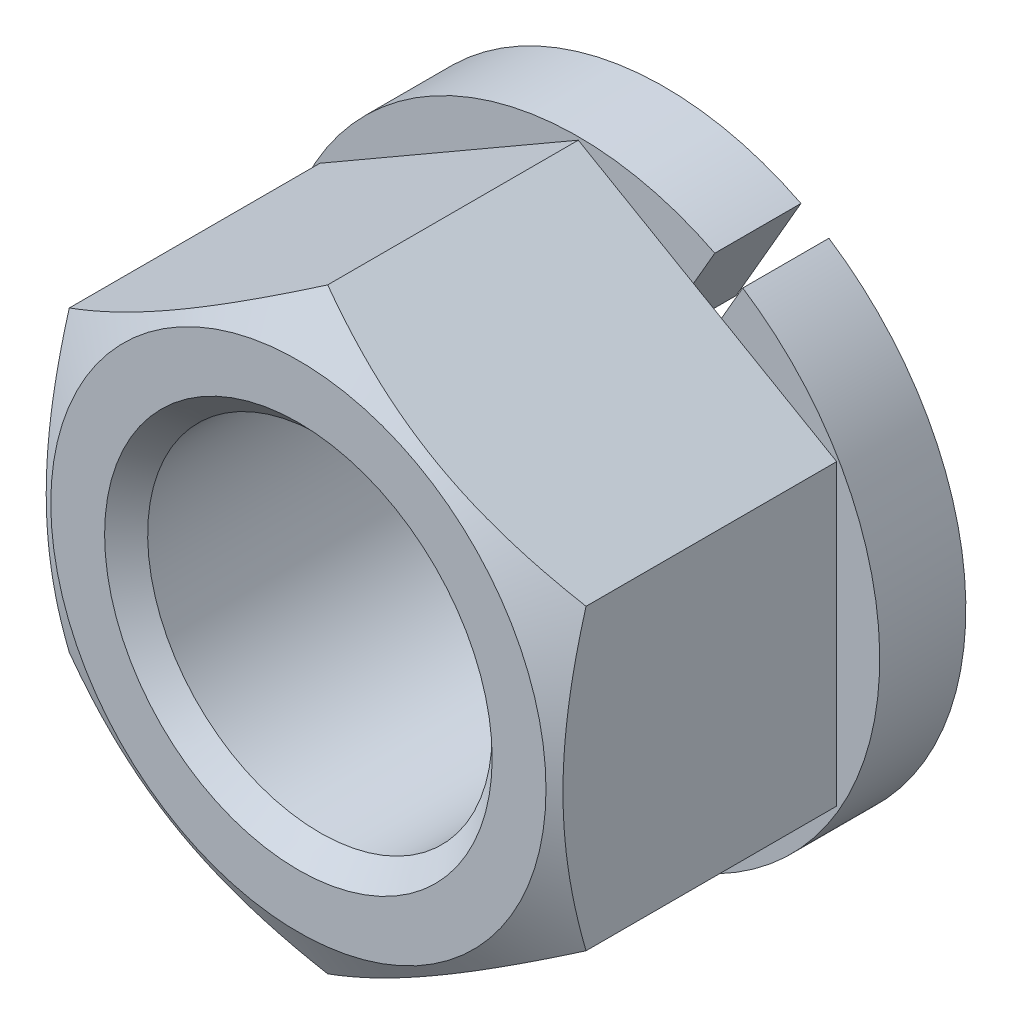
ISO-10303-21;
HEADER;
FILE_DESCRIPTION(('STEP AP214'),'2;1');
FILE_NAME('part.step','',(''),(''),'','','');
FILE_SCHEMA(('AUTOMOTIVE_DESIGN { 1 0 10303 214 1 1 1 1 }'));
ENDSEC;
DATA;
#1=APPLICATION_CONTEXT('core data for automotive mechanical design processes');
#2=APPLICATION_PROTOCOL_DEFINITION('international standard','automotive_design',2000,#1);
#3=PRODUCT_CONTEXT('',#1,'mechanical');
#4=PRODUCT('Part','Part','',(#3));
#5=PRODUCT_RELATED_PRODUCT_CATEGORY('part','',(#4));
#6=PRODUCT_DEFINITION_FORMATION('','',#4);
#7=PRODUCT_DEFINITION_CONTEXT('part definition',#1,'design');
#8=PRODUCT_DEFINITION('design','',#6,#7);
#9=PRODUCT_DEFINITION_SHAPE('','',#8);
#10=(LENGTH_UNIT() NAMED_UNIT(*) SI_UNIT(.MILLI.,.METRE.));
#11=(NAMED_UNIT(*) PLANE_ANGLE_UNIT() SI_UNIT($,.RADIAN.));
#12=(NAMED_UNIT(*) SI_UNIT($,.STERADIAN.) SOLID_ANGLE_UNIT());
#13=UNCERTAINTY_MEASURE_WITH_UNIT(LENGTH_MEASURE(1.E-05),#10,'distance_accuracy_value','');
#14=(GEOMETRIC_REPRESENTATION_CONTEXT(3) GLOBAL_UNCERTAINTY_ASSIGNED_CONTEXT((#13)) GLOBAL_UNIT_ASSIGNED_CONTEXT((#10,
#11,#12)) REPRESENTATION_CONTEXT('',''));
#15=CARTESIAN_POINT('',(0.,0.,0.));
#16=DIRECTION('',(0.,0.,1.));
#17=DIRECTION('',(1.,0.,0.));
#18=AXIS2_PLACEMENT_3D('',#15,#16,#17);
#19=CARTESIAN_POINT('',(-12.,20.7846096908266,17.));
#20=DIRECTION('',(0.,0.,1.));
#21=DIRECTION('',(1.,0.,0.));
#22=AXIS2_PLACEMENT_3D('',#19,#20,#21);
#23=PLANE('',#22);
#24=CARTESIAN_POINT('',(0.,0.,17.));
#25=DIRECTION('',(0.,0.,1.));
#26=DIRECTION('',(1.,0.,0.));
#27=AXIS2_PLACEMENT_3D('',#24,#25,#26);
#28=CIRCLE('',#27,9.);
#29=CARTESIAN_POINT('',(9.,0.,17.));
#30=VERTEX_POINT('',#29);
#31=EDGE_CURVE('E9',#30,#30,#28,.F.);
#32=ORIENTED_EDGE('',*,*,#31,.T.);
#33=EDGE_LOOP('',(#32));
#34=FACE_BOUND('',#33,.T.);
#35=CARTESIAN_POINT('',(0.,0.,17.));
#36=DIRECTION('',(0.,0.,-1.));
#37=DIRECTION('',(-1.,0.,0.));
#38=AXIS2_PLACEMENT_3D('',#35,#36,#37);
#39=CIRCLE('',#38,11.5);
#40=CARTESIAN_POINT('',(-11.5,0.,17.));
#41=VERTEX_POINT('',#40);
#42=EDGE_CURVE('E137',#41,#41,#39,.T.);
#43=ORIENTED_EDGE('',*,*,#42,.F.);
#44=EDGE_LOOP('',(#43));
#45=FACE_BOUND('',#44,.T.);
#46=ADVANCED_FACE('F14',(#34,#45),#23,.T.);
#47=CARTESIAN_POINT('',(12.,6.92820323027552,17.));
#48=DIRECTION('',(-0.5,-0.866025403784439,0.));
#49=DIRECTION('',(0.866025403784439,-0.5,0.));
#50=AXIS2_PLACEMENT_3D('',#47,#48,#49);
#51=PLANE('',#50);
#52=DIRECTION('',(0.,0.,-1.));
#53=VECTOR('',#52,1.);
#54=CARTESIAN_POINT('',(0.,13.856406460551,17.));
#55=LINE('',#54,#53);
#56=CARTESIAN_POINT('',(0.,13.856406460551,15.6395280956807));
#57=VERTEX_POINT('',#56);
#58=CARTESIAN_POINT('',(0.,13.856406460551,4.));
#59=VERTEX_POINT('',#58);
#60=EDGE_CURVE('E221',#57,#59,#55,.T.);
#61=ORIENTED_EDGE('',*,*,#60,.F.);
#62=CARTESIAN_POINT('',(-0.0002,13.8565219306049,15.6394614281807));
#63=CARTESIAN_POINT('',(0.263585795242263,13.7042251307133,15.7273752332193));
#64=CARTESIAN_POINT('',(0.528355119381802,13.5513604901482,15.8112988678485));
#65=CARTESIAN_POINT('',(1.06001701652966,13.244405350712,15.9700586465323));
#66=CARTESIAN_POINT('',(1.32691025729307,13.0903144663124,16.0448918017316));
#67=CARTESIAN_POINT('',(2.13189040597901,12.6255589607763,16.254307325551));
#68=CARTESIAN_POINT('',(2.67315507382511,12.3130596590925,16.3734216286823));
#69=CARTESIAN_POINT('',(3.48313282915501,11.8454187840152,16.513093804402));
#70=CARTESIAN_POINT('',(3.74942610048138,11.6916742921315,16.5528810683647));
#71=CARTESIAN_POINT('',(4.28324559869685,11.3834734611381,16.6196014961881));
#72=CARTESIAN_POINT('',(4.55077184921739,11.2290171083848,16.6465344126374));
#73=CARTESIAN_POINT('',(5.08627036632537,10.9198468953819,16.6868562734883));
#74=CARTESIAN_POINT('',(5.35424172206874,10.7651335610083,16.7002613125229));
#75=CARTESIAN_POINT('',(5.89043273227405,10.4555635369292,16.713241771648));
#76=CARTESIAN_POINT('',(6.15865237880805,10.3007068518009,16.7128176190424));
#77=CARTESIAN_POINT('',(6.66008937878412,10.011202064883,16.6991048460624));
#78=CARTESIAN_POINT('',(6.89334249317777,9.87653331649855,16.6874888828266));
#79=CARTESIAN_POINT('',(7.35931224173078,9.60750555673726,16.6540168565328));
#80=CARTESIAN_POINT('',(7.59202883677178,9.47314656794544,16.632160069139));
#81=CARTESIAN_POINT('',(8.05679907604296,9.2048113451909,16.5785874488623));
#82=CARTESIAN_POINT('',(8.28885201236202,9.07083551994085,16.5468634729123));
#83=CARTESIAN_POINT('',(8.75186996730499,8.80351197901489,16.4741130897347));
#84=CARTESIAN_POINT('',(8.98283491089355,8.67016430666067,16.433086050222));
#85=CARTESIAN_POINT('',(9.68394195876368,8.26537996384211,16.2950132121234));
#86=CARTESIAN_POINT('',(10.1520537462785,7.99511549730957,16.1841999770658));
#87=CARTESIAN_POINT('',(11.0812971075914,7.4586165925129,15.9326990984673));
#88=CARTESIAN_POINT('',(11.5424405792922,7.19237528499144,15.7920705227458));
#89=CARTESIAN_POINT('',(12.0002,6.92808776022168,15.6394614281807));
#90=B_SPLINE_CURVE_WITH_KNOTS('',3,(#62,#63,#64,#65,#66,#67,#68,#69,#70,#71,#72,#73,#74,#75,#76,
#77,#78,#79,#80,#81,#82,#83,#84,#85,#86,#87,#88,#89),.UNSPECIFIED.,.F.,.F.,(4,2,2,2,2,2,2,2,2,2,
2,2,2,4),(0.,0.951004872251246,1.90232158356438,3.80900466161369,4.73894551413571,
5.66890426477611,6.59775529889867,7.52657763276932,8.3351464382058,9.1437724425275,
9.95306755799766,10.7624176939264,12.4167102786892,14.0677556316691),.UNSPECIFIED.);
#91=CARTESIAN_POINT('',(12.,6.92820323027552,15.6395280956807));
#92=VERTEX_POINT('',#91);
#93=EDGE_CURVE('E196',#57,#92,#90,.T.);
#94=ORIENTED_EDGE('',*,*,#93,.T.);
#95=DIRECTION('',(0.,0.,-1.));
#96=VECTOR('',#95,1.);
#97=CARTESIAN_POINT('',(12.,6.92820323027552,17.));
#98=LINE('',#97,#96);
#99=CARTESIAN_POINT('',(12.,6.92820323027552,4.));
#100=VERTEX_POINT('',#99);
#101=EDGE_CURVE('E241',#92,#100,#98,.T.);
#102=ORIENTED_EDGE('',*,*,#101,.T.);
#103=DIRECTION('',(-0.866025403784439,0.5,0.));
#104=VECTOR('',#103,1.);
#105=CARTESIAN_POINT('',(12.,6.92820323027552,4.));
#106=LINE('',#105,#104);
#107=CARTESIAN_POINT('',(6.64951905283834,10.0173048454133,4.));
#108=VERTEX_POINT('',#107);
#109=EDGE_CURVE('E256',#100,#108,#106,.T.);
#110=ORIENTED_EDGE('',*,*,#109,.T.);
#111=DIRECTION('',(0.866025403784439,-0.5,0.));
#112=VECTOR('',#111,1.);
#113=CARTESIAN_POINT('',(12.,6.92820323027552,4.));
#114=LINE('',#113,#112);
#115=CARTESIAN_POINT('',(5.35048094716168,10.7673048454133,4.));
#116=VERTEX_POINT('',#115);
#117=EDGE_CURVE('E129',#116,#108,#114,.T.);
#118=ORIENTED_EDGE('',*,*,#117,.F.);
#119=EDGE_CURVE('E225',#116,#59,#106,.T.);
#120=ORIENTED_EDGE('',*,*,#119,.T.);
#121=EDGE_LOOP('',(#61,#94,#102,#110,#118,#120));
#122=FACE_BOUND('',#121,.T.);
#123=ADVANCED_FACE('F206',(#122),#51,.F.);
#124=CARTESIAN_POINT('',(0.,13.856406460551,17.));
#125=DIRECTION('',(0.5,-0.866025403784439,0.));
#126=DIRECTION('',(0.866025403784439,0.5,0.));
#127=AXIS2_PLACEMENT_3D('',#124,#125,#126);
#128=PLANE('',#127);
#129=DIRECTION('',(0.,0.,-1.));
#130=VECTOR('',#129,1.);
#131=CARTESIAN_POINT('',(-12.,6.92820323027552,17.));
#132=LINE('',#131,#130);
#133=CARTESIAN_POINT('',(-12.,6.92820323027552,15.6395280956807));
#134=VERTEX_POINT('',#133);
#135=CARTESIAN_POINT('',(-12.,6.92820323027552,4.));
#136=VERTEX_POINT('',#135);
#137=EDGE_CURVE('E228',#134,#136,#132,.T.);
#138=ORIENTED_EDGE('',*,*,#137,.F.);
#139=CARTESIAN_POINT('',(-12.0002,6.92808776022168,15.6394614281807));
#140=CARTESIAN_POINT('',(-11.7364142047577,7.0803845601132,15.7273752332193));
#141=CARTESIAN_POINT('',(-11.4716448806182,7.23324920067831,15.8112988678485));
#142=CARTESIAN_POINT('',(-10.9399829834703,7.5402043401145,15.9700586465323));
#143=CARTESIAN_POINT('',(-10.6730897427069,7.69429522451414,16.0448918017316));
#144=CARTESIAN_POINT('',(-9.86810959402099,8.15905073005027,16.254307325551));
#145=CARTESIAN_POINT('',(-9.3268449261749,8.47155003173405,16.3734216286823));
#146=CARTESIAN_POINT('',(-8.516867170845,8.93919090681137,16.513093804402));
#147=CARTESIAN_POINT('',(-8.25057389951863,9.09293539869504,16.5528810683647));
#148=CARTESIAN_POINT('',(-7.71675440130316,9.40113622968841,16.6196014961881));
#149=CARTESIAN_POINT('',(-7.44922815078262,9.55559258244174,16.6465344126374));
#150=CARTESIAN_POINT('',(-6.91372963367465,9.86476279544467,16.6868562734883));
#151=CARTESIAN_POINT('',(-6.64575827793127,10.0194761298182,16.7002613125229));
#152=CARTESIAN_POINT('',(-6.10956726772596,10.3290461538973,16.713241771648));
#153=CARTESIAN_POINT('',(-5.84134762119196,10.4839028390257,16.7128176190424));
#154=CARTESIAN_POINT('',(-5.33991062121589,10.7734076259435,16.6991048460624));
#155=CARTESIAN_POINT('',(-5.10665750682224,10.908076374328,16.6874888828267));
#156=CARTESIAN_POINT('',(-4.64068775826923,11.1771041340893,16.6540168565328));
#157=CARTESIAN_POINT('',(-4.40797116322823,11.3114631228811,16.632160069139));
#158=CARTESIAN_POINT('',(-3.94320092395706,11.5797983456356,16.5785874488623));
#159=CARTESIAN_POINT('',(-3.711147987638,11.7137741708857,16.5468634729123));
#160=CARTESIAN_POINT('',(-3.24813003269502,11.9810977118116,16.4741130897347));
#161=CARTESIAN_POINT('',(-3.01716508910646,12.1144453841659,16.433086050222));
#162=CARTESIAN_POINT('',(-2.31605804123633,12.5192297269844,16.2950132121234));
#163=CARTESIAN_POINT('',(-1.84794625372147,12.789494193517,16.1841999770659));
#164=CARTESIAN_POINT('',(-0.918702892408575,13.3259930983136,15.9326990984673));
#165=CARTESIAN_POINT('',(-0.457559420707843,13.5922344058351,15.7920705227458));
#166=CARTESIAN_POINT('',(0.000200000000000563,13.8565219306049,15.6394614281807));
#167=B_SPLINE_CURVE_WITH_KNOTS('',3,(#139,#140,#141,#142,#143,#144,#145,#146,#147,#148,#149,
#150,#151,#152,#153,#154,#155,#156,#157,#158,#159,#160,#161,#162,#163,#164,#165,#166),
.UNSPECIFIED.,.F.,.F.,(4,2,2,2,2,2,2,2,2,2,2,2,2,4),(0.,0.951004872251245,1.90232158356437,
3.80900466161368,4.7389455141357,5.66890426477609,6.59775529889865,7.5265776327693,
8.33514643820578,9.14377244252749,9.95306755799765,10.7624176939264,12.4167102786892,
14.0677556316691),.UNSPECIFIED.);
#168=EDGE_CURVE('E189',#134,#57,#167,.T.);
#169=ORIENTED_EDGE('',*,*,#168,.T.);
#170=ORIENTED_EDGE('',*,*,#60,.T.);
#171=DIRECTION('',(-0.866025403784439,-0.5,0.));
#172=VECTOR('',#171,1.);
#173=CARTESIAN_POINT('',(0.,13.856406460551,4.));
#174=LINE('',#173,#172);
#175=EDGE_CURVE('E255',#59,#136,#174,.T.);
#176=ORIENTED_EDGE('',*,*,#175,.T.);
#177=EDGE_LOOP('',(#138,#169,#170,#176));
#178=FACE_BOUND('',#177,.T.);
#179=ADVANCED_FACE('F202',(#178),#128,.F.);
#180=CARTESIAN_POINT('',(-12.,6.92820323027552,17.));
#181=DIRECTION('',(1.,0.,0.));
#182=DIRECTION('',(0.,1.,0.));
#183=AXIS2_PLACEMENT_3D('',#180,#181,#182);
#184=PLANE('',#183);
#185=DIRECTION('',(0.,0.,-1.));
#186=VECTOR('',#185,1.);
#187=CARTESIAN_POINT('',(-12.,-6.92820323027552,17.));
#188=LINE('',#187,#186);
#189=CARTESIAN_POINT('',(-12.,-6.92820323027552,15.6395280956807));
#190=VERTEX_POINT('',#189);
#191=CARTESIAN_POINT('',(-12.,-6.92820323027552,4.));
#192=VERTEX_POINT('',#191);
#193=EDGE_CURVE('E230',#190,#192,#188,.T.);
#194=ORIENTED_EDGE('',*,*,#193,.F.);
#195=CARTESIAN_POINT('',(-12.,-18.4964065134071,10.9100733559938));
#196=CARTESIAN_POINT('',(-12.,-18.2348249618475,11.0367669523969));
#197=CARTESIAN_POINT('',(-12.,-17.9729333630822,11.1628200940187));
#198=CARTESIAN_POINT('',(-12.,-17.4484653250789,11.4135001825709));
#199=CARTESIAN_POINT('',(-12.,-17.1858888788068,11.5381271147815));
#200=CARTESIAN_POINT('',(-12.,-16.3969636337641,11.909684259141));
#201=CARTESIAN_POINT('',(-12.,-15.8694980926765,12.1542523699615));
#202=CARTESIAN_POINT('',(-12.,-14.8080735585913,12.6369300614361));
#203=CARTESIAN_POINT('',(-12.,-14.274094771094,12.8749962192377));
#204=CARTESIAN_POINT('',(-12.,-13.2018506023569,13.341236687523));
#205=CARTESIAN_POINT('',(-12.,-12.6635854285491,13.5694114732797));
#206=CARTESIAN_POINT('',(-12.,-11.5649927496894,14.0201902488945));
#207=CARTESIAN_POINT('',(-12.,-11.0045014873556,14.2423972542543));
#208=CARTESIAN_POINT('',(-12.,-9.87691575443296,14.6697177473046));
#209=CARTESIAN_POINT('',(-12.,-9.30982054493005,14.8748293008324));
#210=CARTESIAN_POINT('',(-12.,-8.1692421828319,15.2624880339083));
#211=CARTESIAN_POINT('',(-12.,-7.59577502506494,15.445081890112));
#212=CARTESIAN_POINT('',(-12.,-6.44056116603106,15.7817809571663));
#213=CARTESIAN_POINT('',(-12.,-5.85881717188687,15.9358952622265));
#214=CARTESIAN_POINT('',(-12.,-4.98150097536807,16.1396561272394));
#215=CARTESIAN_POINT('',(-12.,-4.68906134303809,16.202876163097));
#216=CARTESIAN_POINT('',(-12.,-4.10220552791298,16.319414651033));
#217=CARTESIAN_POINT('',(-12.,-3.80778938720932,16.372733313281));
#218=CARTESIAN_POINT('',(-12.,-3.21719134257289,16.4685211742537));
#219=CARTESIAN_POINT('',(-12.,-2.9210094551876,16.5109904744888));
#220=CARTESIAN_POINT('',(-12.,-2.32720366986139,16.5842281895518));
#221=CARTESIAN_POINT('',(-12.,-2.02957982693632,16.6149970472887));
#222=CARTESIAN_POINT('',(-12.,-1.43714190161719,16.6638431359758));
#223=CARTESIAN_POINT('',(-12.,-1.1423409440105,16.6820785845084));
#224=CARTESIAN_POINT('',(-12.,-0.552233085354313,16.7060743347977));
#225=CARTESIAN_POINT('',(-12.,-0.25692619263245,16.7118348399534));
#226=CARTESIAN_POINT('',(-12.,0.333668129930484,16.7107440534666));
#227=CARTESIAN_POINT('',(-12.,0.628955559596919,16.7038926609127));
#228=CARTESIAN_POINT('',(-12.,1.21898241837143,16.6777432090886));
#229=CARTESIAN_POINT('',(-12.,1.5137218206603,16.6584445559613));
#230=CARTESIAN_POINT('',(-12.,2.22554423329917,16.5972105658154));
#231=CARTESIAN_POINT('',(-12.,2.64211159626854,16.5491768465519));
#232=CARTESIAN_POINT('',(-12.,3.47208181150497,16.4308891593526));
#233=CARTESIAN_POINT('',(-12.,3.88548421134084,16.3606320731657));
#234=CARTESIAN_POINT('',(-12.,4.7087553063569,16.2003971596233));
#235=CARTESIAN_POINT('',(-12.,5.1186209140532,16.1104036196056));
#236=CARTESIAN_POINT('',(-12.,5.93420536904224,15.9134352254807));
#237=CARTESIAN_POINT('',(-12.,6.33992428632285,15.8064606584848));
#238=CARTESIAN_POINT('',(-12.,7.15607883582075,15.5756142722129));
#239=CARTESIAN_POINT('',(-12.,7.56642387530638,15.451424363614));
#240=CARTESIAN_POINT('',(-12.,8.38307044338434,15.1904609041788));
#241=CARTESIAN_POINT('',(-12.,8.78937194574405,15.0536872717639));
#242=CARTESIAN_POINT('',(-12.,9.59813666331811,14.7697062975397));
#243=CARTESIAN_POINT('',(-12.,10.0006011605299,14.6225025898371));
#244=CARTESIAN_POINT('',(-12.,10.8022117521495,14.319368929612));
#245=CARTESIAN_POINT('',(-12.,11.2013578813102,14.1634390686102));
#246=CARTESIAN_POINT('',(-12.,12.1262127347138,13.7923427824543));
#247=CARTESIAN_POINT('',(-12.,12.6508137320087,13.5744201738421));
#248=CARTESIAN_POINT('',(-12.,13.6957041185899,13.1284442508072));
#249=CARTESIAN_POINT('',(-12.,14.2159932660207,12.9003903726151));
#250=CARTESIAN_POINT('',(-12.,15.2530413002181,12.4361348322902));
#251=CARTESIAN_POINT('',(-12.,15.7697994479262,12.199931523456));
#252=CARTESIAN_POINT('',(-12.,16.8002554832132,11.7209820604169));
#253=CARTESIAN_POINT('',(-12.,17.3139534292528,11.4782360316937));
#254=CARTESIAN_POINT('',(-12.,18.3393079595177,10.9871475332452));
#255=CARTESIAN_POINT('',(-12.,18.8509619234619,10.7387996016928));
#256=CARTESIAN_POINT('',(-12.,19.8721014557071,10.2376861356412));
#257=CARTESIAN_POINT('',(-12.,20.3815870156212,9.98492058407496));
#258=CARTESIAN_POINT('',(-12.,21.3986564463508,9.47574394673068));
#259=CARTESIAN_POINT('',(-12.,21.9062405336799,9.21933329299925));
#260=CARTESIAN_POINT('',(-12.,22.9198367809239,8.70342199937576));
#261=CARTESIAN_POINT('',(-12.,23.4258489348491,8.44392134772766));
#262=CARTESIAN_POINT('',(-12.,24.85998839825,7.70377050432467));
#263=CARTESIAN_POINT('',(-12.,25.786517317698,7.22002319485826));
#264=CARTESIAN_POINT('',(-12.,27.6361269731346,6.24592447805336));
#265=CARTESIAN_POINT('',(-12.,28.5592075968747,5.7555728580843));
#266=CARTESIAN_POINT('',(-12.,30.4004956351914,4.77094779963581));
#267=CARTESIAN_POINT('',(-12.,31.3187093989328,4.27668622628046));
#268=CARTESIAN_POINT('',(-12.,32.6943950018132,3.532332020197));
#269=CARTESIAN_POINT('',(-12.,33.1526727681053,3.28372664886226));
#270=CARTESIAN_POINT('',(-12.,34.0687438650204,2.78562658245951));
#271=CARTESIAN_POINT('',(-12.,34.5265371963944,2.53613188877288));
#272=CARTESIAN_POINT('',(-12.,34.9841154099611,2.28624317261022));
#273=B_SPLINE_CURVE_WITH_KNOTS('',3,(#195,#196,#197,#198,#199,#200,#201,#202,#203,#204,#205,
#206,#207,#208,#209,#210,#211,#212,#213,#214,#215,#216,#217,#218,#219,#220,#221,#222,#223,#224,
#225,#226,#227,#228,#229,#230,#231,#232,#233,#234,#235,#236,#237,#238,#239,#240,#241,#242,#243,
#244,#245,#246,#247,#248,#249,#250,#251,#252,#253,#254,#255,#256,#257,#258,#259,#260,#261,#262,
#263,#264,#265,#266,#267,#268,#269,#270,#271,#272),.UNSPECIFIED.,.F.,.F.,(4,2,2,2,2,2,2,2,2,2,2,
2,2,2,2,2,2,2,2,2,2,2,2,2,2,2,2,2,2,2,2,2,2,2,2,2,2,2,4),(0.,0.871941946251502,1.74389288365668,
3.48805876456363,5.24191326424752,6.99568339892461,8.80426505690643,10.6130510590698,
12.4180222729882,14.2224161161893,15.1198609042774,16.0172866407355,16.9147039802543,
17.8120873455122,18.6979234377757,19.5837450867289,20.4695738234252,21.355444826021,
22.6127292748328,23.8701902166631,25.1286559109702,26.3871003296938,27.6730372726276,
28.9589825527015,30.2444819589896,31.5299678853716,33.234016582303,34.9381602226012,
36.6426502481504,38.34710760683,40.0533055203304,41.7595100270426,43.46551395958,
45.1715243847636,48.30711904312,51.4428148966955,54.5711716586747,56.1352707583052,
57.6993674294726),.UNSPECIFIED.);
#274=EDGE_CURVE('E182',#190,#134,#273,.T.);
#275=ORIENTED_EDGE('',*,*,#274,.T.);
#276=ORIENTED_EDGE('',*,*,#137,.T.);
#277=DIRECTION('',(0.,-1.,0.));
#278=VECTOR('',#277,1.);
#279=CARTESIAN_POINT('',(-12.,6.92820323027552,4.));
#280=LINE('',#279,#278);
#281=EDGE_CURVE('E252',#136,#192,#280,.T.);
#282=ORIENTED_EDGE('',*,*,#281,.T.);
#283=EDGE_LOOP('',(#194,#275,#276,#282));
#284=FACE_BOUND('',#283,.T.);
#285=ADVANCED_FACE('F205',(#284),#184,.F.);
#286=CARTESIAN_POINT('',(-12.,-6.92820323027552,17.));
#287=DIRECTION('',(0.5,0.866025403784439,0.));
#288=DIRECTION('',(-0.866025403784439,0.5,0.));
#289=AXIS2_PLACEMENT_3D('',#286,#287,#288);
#290=PLANE('',#289);
#291=DIRECTION('',(0.,0.,-1.));
#292=VECTOR('',#291,1.);
#293=CARTESIAN_POINT('',(0.,-13.856406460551,17.));
#294=LINE('',#293,#292);
#295=CARTESIAN_POINT('',(0.,-13.856406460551,15.6395280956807));
#296=VERTEX_POINT('',#295);
#297=CARTESIAN_POINT('',(0.,-13.856406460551,4.));
#298=VERTEX_POINT('',#297);
#299=EDGE_CURVE('E235',#296,#298,#294,.T.);
#300=ORIENTED_EDGE('',*,*,#299,.F.);
#301=CARTESIAN_POINT('',(0.000199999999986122,-13.8565219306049,15.6394614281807));
#302=CARTESIAN_POINT('',(-0.26358579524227,-13.7042251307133,15.7273752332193));
#303=CARTESIAN_POINT('',(-0.528355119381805,-13.5513604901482,15.8112988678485));
#304=CARTESIAN_POINT('',(-1.06001701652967,-13.244405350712,15.9700586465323));
#305=CARTESIAN_POINT('',(-1.32691025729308,-13.0903144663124,16.0448918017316));
#306=CARTESIAN_POINT('',(-2.13189040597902,-12.6255589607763,16.254307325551));
#307=CARTESIAN_POINT('',(-2.67315507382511,-12.3130596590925,16.3734216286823));
#308=CARTESIAN_POINT('',(-3.48313282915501,-11.8454187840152,16.513093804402));
#309=CARTESIAN_POINT('',(-3.74942610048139,-11.6916742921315,16.5528810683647));
#310=CARTESIAN_POINT('',(-4.28324559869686,-11.3834734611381,16.6196014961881));
#311=CARTESIAN_POINT('',(-4.5507718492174,-11.2290171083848,16.6465344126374));
#312=CARTESIAN_POINT('',(-5.08627036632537,-10.9198468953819,16.6868562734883));
#313=CARTESIAN_POINT('',(-5.35424172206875,-10.7651335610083,16.7002613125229));
#314=CARTESIAN_POINT('',(-5.89043273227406,-10.4555635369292,16.713241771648));
#315=CARTESIAN_POINT('',(-6.15865237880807,-10.3007068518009,16.7128176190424));
#316=CARTESIAN_POINT('',(-6.66008937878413,-10.0112020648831,16.6991048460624));
#317=CARTESIAN_POINT('',(-6.89334249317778,-9.87653331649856,16.6874888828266));
#318=CARTESIAN_POINT('',(-7.35931224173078,-9.60750555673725,16.6540168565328));
#319=CARTESIAN_POINT('',(-7.59202883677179,-9.47314656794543,16.632160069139));
#320=CARTESIAN_POINT('',(-8.05679907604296,-9.2048113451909,16.5785874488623));
#321=CARTESIAN_POINT('',(-8.28885201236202,-9.07083551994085,16.5468634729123));
#322=CARTESIAN_POINT('',(-8.751869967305,-8.80351197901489,16.4741130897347));
#323=CARTESIAN_POINT('',(-8.98283491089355,-8.67016430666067,16.433086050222));
#324=CARTESIAN_POINT('',(-9.68394195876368,-8.26537996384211,16.2950132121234));
#325=CARTESIAN_POINT('',(-10.1520537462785,-7.99511549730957,16.1841999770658));
#326=CARTESIAN_POINT('',(-11.0812971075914,-7.45861659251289,15.9326990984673));
#327=CARTESIAN_POINT('',(-11.5424405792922,-7.19237528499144,15.7920705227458));
#328=CARTESIAN_POINT('',(-12.0002,-6.92808776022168,15.6394614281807));
#329=B_SPLINE_CURVE_WITH_KNOTS('',3,(#301,#302,#303,#304,#305,#306,#307,#308,#309,#310,#311,
#312,#313,#314,#315,#316,#317,#318,#319,#320,#321,#322,#323,#324,#325,#326,#327,#328),
.UNSPECIFIED.,.F.,.F.,(4,2,2,2,2,2,2,2,2,2,2,2,2,4),(0.,0.951004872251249,1.90232158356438,
3.8090046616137,4.73894551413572,5.66890426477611,6.59775529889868,7.52657763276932,
8.3351464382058,9.14377244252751,9.95306755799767,10.7624176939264,12.4167102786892,
14.0677556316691),.UNSPECIFIED.);
#330=EDGE_CURVE('E149',#296,#190,#329,.T.);
#331=ORIENTED_EDGE('',*,*,#330,.T.);
#332=ORIENTED_EDGE('',*,*,#193,.T.);
#333=DIRECTION('',(0.866025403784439,-0.5,0.));
#334=VECTOR('',#333,1.);
#335=CARTESIAN_POINT('',(-12.,-6.92820323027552,4.));
#336=LINE('',#335,#334);
#337=EDGE_CURVE('E249',#192,#298,#336,.T.);
#338=ORIENTED_EDGE('',*,*,#337,.T.);
#339=EDGE_LOOP('',(#300,#331,#332,#338));
#340=FACE_BOUND('',#339,.T.);
#341=ADVANCED_FACE('F307',(#340),#290,.F.);
#342=CARTESIAN_POINT('',(0.,-13.856406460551,17.));
#343=DIRECTION('',(-0.5,0.866025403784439,0.));
#344=DIRECTION('',(-0.866025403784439,-0.5,0.));
#345=AXIS2_PLACEMENT_3D('',#342,#343,#344);
#346=PLANE('',#345);
#347=DIRECTION('',(0.,0.,-1.));
#348=VECTOR('',#347,1.);
#349=CARTESIAN_POINT('',(12.,-6.92820323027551,17.));
#350=LINE('',#349,#348);
#351=CARTESIAN_POINT('',(12.,-6.92820323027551,15.6395280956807));
#352=VERTEX_POINT('',#351);
#353=CARTESIAN_POINT('',(12.,-6.92820323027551,4.));
#354=VERTEX_POINT('',#353);
#355=EDGE_CURVE('E238',#352,#354,#350,.T.);
#356=ORIENTED_EDGE('',*,*,#355,.F.);
#357=CARTESIAN_POINT('',(12.0002,-6.92808776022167,15.6394614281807));
#358=CARTESIAN_POINT('',(11.7364142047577,-7.0803845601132,15.7273752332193));
#359=CARTESIAN_POINT('',(11.4716448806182,-7.23324920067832,15.8112988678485));
#360=CARTESIAN_POINT('',(10.9399829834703,-7.54020434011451,15.9700586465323));
#361=CARTESIAN_POINT('',(10.6730897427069,-7.69429522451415,16.0448918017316));
#362=CARTESIAN_POINT('',(9.868109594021,-8.15905073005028,16.254307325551));
#363=CARTESIAN_POINT('',(9.32684492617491,-8.47155003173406,16.3734216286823));
#364=CARTESIAN_POINT('',(8.51686717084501,-8.93919090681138,16.513093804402));
#365=CARTESIAN_POINT('',(8.25057389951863,-9.09293539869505,16.5528810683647));
#366=CARTESIAN_POINT('',(7.71675440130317,-9.40113622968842,16.6196014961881));
#367=CARTESIAN_POINT('',(7.44922815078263,-9.55559258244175,16.6465344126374));
#368=CARTESIAN_POINT('',(6.91372963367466,-9.86476279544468,16.6868562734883));
#369=CARTESIAN_POINT('',(6.64575827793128,-10.0194761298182,16.7002613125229));
#370=CARTESIAN_POINT('',(6.10956726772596,-10.3290461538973,16.713241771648));
#371=CARTESIAN_POINT('',(5.84134762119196,-10.4839028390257,16.7128176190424));
#372=CARTESIAN_POINT('',(5.33991062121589,-10.7734076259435,16.6991048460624));
#373=CARTESIAN_POINT('',(5.10665750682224,-10.908076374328,16.6874888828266));
#374=CARTESIAN_POINT('',(4.64068775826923,-11.1771041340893,16.6540168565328));
#375=CARTESIAN_POINT('',(4.40797116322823,-11.3114631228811,16.632160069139));
#376=CARTESIAN_POINT('',(3.94320092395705,-11.5797983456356,16.5785874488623));
#377=CARTESIAN_POINT('',(3.71114798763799,-11.7137741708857,16.5468634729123));
#378=CARTESIAN_POINT('',(3.24813003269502,-11.9810977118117,16.4741130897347));
#379=CARTESIAN_POINT('',(3.01716508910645,-12.1144453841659,16.433086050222));
#380=CARTESIAN_POINT('',(2.31605804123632,-12.5192297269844,16.2950132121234));
#381=CARTESIAN_POINT('',(1.84794625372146,-12.789494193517,16.1841999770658));
#382=CARTESIAN_POINT('',(0.918702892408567,-13.3259930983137,15.9326990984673));
#383=CARTESIAN_POINT('',(0.457559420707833,-13.5922344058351,15.7920705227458));
#384=CARTESIAN_POINT('',(-0.00020000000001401,-13.8565219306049,15.6394614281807));
#385=B_SPLINE_CURVE_WITH_KNOTS('',3,(#357,#358,#359,#360,#361,#362,#363,#364,#365,#366,#367,
#368,#369,#370,#371,#372,#373,#374,#375,#376,#377,#378,#379,#380,#381,#382,#383,#384),
.UNSPECIFIED.,.F.,.F.,(4,2,2,2,2,2,2,2,2,2,2,2,2,4),(0.,0.951004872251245,1.90232158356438,
3.80900466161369,4.7389455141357,5.66890426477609,6.59775529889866,7.5265776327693,
8.33514643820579,9.1437724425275,9.95306755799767,10.7624176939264,12.4167102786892,
14.0677556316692),.UNSPECIFIED.);
#386=EDGE_CURVE('E37',#352,#296,#385,.T.);
#387=ORIENTED_EDGE('',*,*,#386,.T.);
#388=ORIENTED_EDGE('',*,*,#299,.T.);
#389=DIRECTION('',(0.866025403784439,0.5,0.));
#390=VECTOR('',#389,1.);
#391=CARTESIAN_POINT('',(0.,-13.856406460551,4.));
#392=LINE('',#391,#390);
#393=EDGE_CURVE('E246',#298,#354,#392,.T.);
#394=ORIENTED_EDGE('',*,*,#393,.T.);
#395=EDGE_LOOP('',(#356,#387,#388,#394));
#396=FACE_BOUND('',#395,.T.);
#397=ADVANCED_FACE('F156',(#396),#346,.F.);
#398=CARTESIAN_POINT('',(12.,-6.92820323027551,17.));
#399=DIRECTION('',(-1.,0.,0.));
#400=DIRECTION('',(0.,0.,1.));
#401=AXIS2_PLACEMENT_3D('',#398,#399,#400);
#402=PLANE('',#401);
#403=ORIENTED_EDGE('',*,*,#101,.F.);
#404=CARTESIAN_POINT('',(12.,-18.4964065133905,10.9100733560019));
#405=CARTESIAN_POINT('',(12.,-18.2348249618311,11.0367669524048));
#406=CARTESIAN_POINT('',(12.,-17.9729333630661,11.1628200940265));
#407=CARTESIAN_POINT('',(12.,-17.4484653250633,11.4135001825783));
#408=CARTESIAN_POINT('',(12.,-17.1858888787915,11.5381271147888));
#409=CARTESIAN_POINT('',(12.,-16.3969636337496,11.9096842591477));
#410=CARTESIAN_POINT('',(12.,-15.8694980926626,12.1542523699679));
#411=CARTESIAN_POINT('',(12.,-14.8080735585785,12.6369300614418));
#412=CARTESIAN_POINT('',(12.,-14.2740947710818,12.8749962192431));
#413=CARTESIAN_POINT('',(12.,-13.2018506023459,13.3412366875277));
#414=CARTESIAN_POINT('',(12.,-12.6635854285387,13.5694114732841));
#415=CARTESIAN_POINT('',(12.,-11.5649927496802,14.0201902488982));
#416=CARTESIAN_POINT('',(12.,-11.0045014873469,14.2423972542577));
#417=CARTESIAN_POINT('',(12.,-9.87691575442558,14.6697177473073));
#418=CARTESIAN_POINT('',(12.,-9.30982054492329,14.8748293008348));
#419=CARTESIAN_POINT('',(12.,-8.16924218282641,15.2624880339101));
#420=CARTESIAN_POINT('',(12.,-7.59577502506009,15.4450818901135));
#421=CARTESIAN_POINT('',(12.,-6.44056116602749,15.7817809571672));
#422=CARTESIAN_POINT('',(12.,-5.85881717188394,15.9358952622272));
#423=CARTESIAN_POINT('',(12.,-4.9815009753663,16.1396561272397));
#424=CARTESIAN_POINT('',(12.,-4.68906134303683,16.2028761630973));
#425=CARTESIAN_POINT('',(12.,-4.10220552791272,16.319414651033));
#426=CARTESIAN_POINT('',(12.,-3.80778938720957,16.372733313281));
#427=CARTESIAN_POINT('',(12.,-3.21719134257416,16.4685211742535));
#428=CARTESIAN_POINT('',(12.,-2.92100945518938,16.5109904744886));
#429=CARTESIAN_POINT('',(12.,-2.32720366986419,16.5842281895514));
#430=CARTESIAN_POINT('',(12.,-2.02957982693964,16.6149970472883));
#431=CARTESIAN_POINT('',(12.,-1.43714190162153,16.6638431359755));
#432=CARTESIAN_POINT('',(12.,-1.14234094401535,16.6820785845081));
#433=CARTESIAN_POINT('',(12.,-0.552233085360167,16.7060743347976));
#434=CARTESIAN_POINT('',(12.,-0.256926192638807,16.7118348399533));
#435=CARTESIAN_POINT('',(12.,0.333668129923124,16.7107440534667));
#436=CARTESIAN_POINT('',(12.,0.628955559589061,16.7038926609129));
#437=CARTESIAN_POINT('',(12.,1.21898241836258,16.6777432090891));
#438=CARTESIAN_POINT('',(12.,1.51372182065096,16.6584445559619));
#439=CARTESIAN_POINT('',(12.,2.22554423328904,16.5972105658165));
#440=CARTESIAN_POINT('',(12.,2.64211159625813,16.5491768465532));
#441=CARTESIAN_POINT('',(12.,3.47208181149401,16.4308891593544));
#442=CARTESIAN_POINT('',(12.,3.8854842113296,16.3606320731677));
#443=CARTESIAN_POINT('',(12.,4.70875530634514,16.2003971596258));
#444=CARTESIAN_POINT('',(12.,5.11862091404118,16.1104036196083));
#445=CARTESIAN_POINT('',(12.,5.9342053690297,15.9134352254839));
#446=CARTESIAN_POINT('',(12.,6.33992428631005,15.8064606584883));
#447=CARTESIAN_POINT('',(12.,7.15607883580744,15.5756142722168));
#448=CARTESIAN_POINT('',(12.,7.56642387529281,15.4514243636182));
#449=CARTESIAN_POINT('',(12.,8.38307044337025,15.1904609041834));
#450=CARTESIAN_POINT('',(12.,8.78937194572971,15.0536872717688));
#451=CARTESIAN_POINT('',(12.,9.59813666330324,14.7697062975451));
#452=CARTESIAN_POINT('',(12.,10.0006011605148,14.6225025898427));
#453=CARTESIAN_POINT('',(12.,10.8022117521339,14.3193689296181));
#454=CARTESIAN_POINT('',(12.,11.2013578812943,14.1634390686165));
#455=CARTESIAN_POINT('',(12.,12.1262127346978,13.7923427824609));
#456=CARTESIAN_POINT('',(12.,12.6508137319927,13.5744201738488));
#457=CARTESIAN_POINT('',(12.,13.695704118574,13.1284442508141));
#458=CARTESIAN_POINT('',(12.,14.2159932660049,12.9003903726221));
#459=CARTESIAN_POINT('',(12.,15.2530413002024,12.4361348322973));
#460=CARTESIAN_POINT('',(12.,15.7697994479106,12.1999315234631));
#461=CARTESIAN_POINT('',(12.,16.8002554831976,11.7209820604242));
#462=CARTESIAN_POINT('',(12.,17.3139534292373,11.478236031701));
#463=CARTESIAN_POINT('',(12.,18.3393079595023,10.9871475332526));
#464=CARTESIAN_POINT('',(12.,18.8509619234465,10.7387996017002));
#465=CARTESIAN_POINT('',(12.,19.8721014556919,10.2376861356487));
#466=CARTESIAN_POINT('',(12.,20.3815870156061,9.9849205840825));
#467=CARTESIAN_POINT('',(12.,21.3986564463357,9.47574394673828));
#468=CARTESIAN_POINT('',(12.,21.9062405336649,9.21933329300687));
#469=CARTESIAN_POINT('',(12.,22.919836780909,8.70342199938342));
#470=CARTESIAN_POINT('',(12.,23.4258489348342,8.44392134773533));
#471=CARTESIAN_POINT('',(12.,24.8599883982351,7.70377050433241));
#472=CARTESIAN_POINT('',(12.,25.7865173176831,7.22002319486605));
#473=CARTESIAN_POINT('',(12.,27.6361269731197,6.24592447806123));
#474=CARTESIAN_POINT('',(12.,28.5592075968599,5.7555728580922));
#475=CARTESIAN_POINT('',(12.,30.4004956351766,4.77094779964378));
#476=CARTESIAN_POINT('',(12.,31.3187093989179,4.27668622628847));
#477=CARTESIAN_POINT('',(12.,32.6943950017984,3.53233202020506));
#478=CARTESIAN_POINT('',(12.,33.1526727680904,3.28372664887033));
#479=CARTESIAN_POINT('',(12.,34.0687438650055,2.78562658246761));
#480=CARTESIAN_POINT('',(12.,34.5265371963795,2.536131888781));
#481=CARTESIAN_POINT('',(12.,34.9841154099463,2.28624317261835));
#482=B_SPLINE_CURVE_WITH_KNOTS('',3,(#404,#405,#406,#407,#408,#409,#410,#411,#412,#413,#414,
#415,#416,#417,#418,#419,#420,#421,#422,#423,#424,#425,#426,#427,#428,#429,#430,#431,#432,#433,
#434,#435,#436,#437,#438,#439,#440,#441,#442,#443,#444,#445,#446,#447,#448,#449,#450,#451,#452,
#453,#454,#455,#456,#457,#458,#459,#460,#461,#462,#463,#464,#465,#466,#467,#468,#469,#470,#471,
#472,#473,#474,#475,#476,#477,#478,#479,#480,#481),.UNSPECIFIED.,.F.,.F.,(4,2,2,2,2,2,2,2,2,2,2,
2,2,2,2,2,2,2,2,2,2,2,2,2,2,2,2,2,2,2,2,2,2,2,2,2,2,2,4),(0.,0.871941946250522,1.74389288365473,
3.48805876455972,5.24191326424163,6.99568339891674,8.80426505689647,10.6130510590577,
12.418022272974,14.2224161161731,15.1198609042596,16.0172866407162,16.9147039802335,
17.8120873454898,18.6979234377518,19.5837450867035,20.4695738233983,21.3554448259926,
22.6127292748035,23.8701902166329,25.128655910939,26.3871003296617,27.6730372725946,
28.9589825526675,30.2444819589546,31.5299678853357,33.2340165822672,34.9381602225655,
36.6426502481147,38.3471076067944,40.0533055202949,41.7595100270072,43.4655139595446,
45.1715243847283,48.3071190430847,51.4428148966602,54.5711716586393,56.1352707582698,
57.6993674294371),.UNSPECIFIED.);
#483=EDGE_CURVE('E172',#92,#352,#482,.F.);
#484=ORIENTED_EDGE('',*,*,#483,.T.);
#485=ORIENTED_EDGE('',*,*,#355,.T.);
#486=DIRECTION('',(0.,1.,0.));
#487=VECTOR('',#486,1.);
#488=CARTESIAN_POINT('',(12.,-6.92820323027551,4.));
#489=LINE('',#488,#487);
#490=EDGE_CURVE('E243',#354,#100,#489,.T.);
#491=ORIENTED_EDGE('',*,*,#490,.T.);
#492=EDGE_LOOP('',(#403,#484,#485,#491));
#493=FACE_BOUND('',#492,.T.);
#494=ADVANCED_FACE('F297',(#493),#402,.F.);
#495=CARTESIAN_POINT('',(0.,0.,17.));
#496=DIRECTION('',(0.,0.,-1.));
#497=DIRECTION('',(-1.,0.,0.));
#498=AXIS2_PLACEMENT_3D('',#495,#496,#497);
#499=CYLINDRICAL_SURFACE('',#498,8.);
#500=DIRECTION('',(0.,0.,-1.));
#501=VECTOR('',#500,1.);
#502=CARTESIAN_POINT('',(4.63190213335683,6.5226898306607,4.));
#503=LINE('',#502,#501);
#504=CARTESIAN_POINT('',(4.63190213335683,6.5226898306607,4.));
#505=VERTEX_POINT('',#504);
#506=CARTESIAN_POINT('',(4.63190213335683,6.5226898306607,0.));
#507=VERTEX_POINT('',#506);
#508=EDGE_CURVE('E131',#505,#507,#503,.T.);
#509=ORIENTED_EDGE('',*,*,#508,.T.);
#510=CARTESIAN_POINT('',(0.,0.,0.));
#511=DIRECTION('',(0.,0.,-1.));
#512=DIRECTION('',(-1.,0.,0.));
#513=AXIS2_PLACEMENT_3D('',#510,#511,#512);
#514=CIRCLE('',#513,8.);
#515=CARTESIAN_POINT('',(3.33286402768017,7.2726898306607,0.));
#516=VERTEX_POINT('',#515);
#517=EDGE_CURVE('E119',#507,#516,#514,.T.);
#518=ORIENTED_EDGE('',*,*,#517,.T.);
#519=DIRECTION('',(0.,0.,-1.));
#520=VECTOR('',#519,1.);
#521=CARTESIAN_POINT('',(3.33286402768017,7.2726898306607,4.));
#522=LINE('',#521,#520);
#523=CARTESIAN_POINT('',(3.33286402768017,7.2726898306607,4.));
#524=VERTEX_POINT('',#523);
#525=EDGE_CURVE('E99',#524,#516,#522,.T.);
#526=ORIENTED_EDGE('',*,*,#525,.F.);
#527=CARTESIAN_POINT('',(0.,0.,4.));
#528=DIRECTION('',(0.,0.,1.));
#529=DIRECTION('',(-1.,0.,0.));
#530=AXIS2_PLACEMENT_3D('',#527,#528,#529);
#531=CIRCLE('',#530,8.);
#532=EDGE_CURVE('E107',#505,#524,#531,.T.);
#533=ORIENTED_EDGE('',*,*,#532,.F.);
#534=EDGE_LOOP('',(#509,#518,#526,#533));
#535=FACE_BOUND('',#534,.T.);
#536=CARTESIAN_POINT('',(0.,0.,16.));
#537=DIRECTION('',(0.,0.,1.));
#538=DIRECTION('',(1.,0.,0.));
#539=AXIS2_PLACEMENT_3D('',#536,#537,#538);
#540=CIRCLE('',#539,8.);
#541=CARTESIAN_POINT('',(8.,0.,16.));
#542=VERTEX_POINT('',#541);
#543=EDGE_CURVE('E22',#542,#542,#540,.T.);
#544=ORIENTED_EDGE('',*,*,#543,.T.);
#545=EDGE_LOOP('',(#544));
#546=FACE_BOUND('',#545,.T.);
#547=ADVANCED_FACE('F116',(#535,#546),#499,.F.);
#548=CARTESIAN_POINT('',(0.,0.,17.));
#549=DIRECTION('',(0.,0.,-1.));
#550=DIRECTION('',(-1.,0.,0.));
#551=AXIS2_PLACEMENT_3D('',#548,#549,#550);
#552=CONICAL_SURFACE('',#551,11.5,1.0471975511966);
#553=ORIENTED_EDGE('',*,*,#42,.T.);
#554=EDGE_LOOP('',(#553));
#555=FACE_BOUND('',#554,.T.);
#556=ORIENTED_EDGE('',*,*,#168,.F.);
#557=ORIENTED_EDGE('',*,*,#274,.F.);
#558=ORIENTED_EDGE('',*,*,#330,.F.);
#559=ORIENTED_EDGE('',*,*,#386,.F.);
#560=ORIENTED_EDGE('',*,*,#483,.F.);
#561=ORIENTED_EDGE('',*,*,#93,.F.);
#562=EDGE_LOOP('',(#556,#557,#558,#559,#560,#561));
#563=FACE_BOUND('',#562,.T.);
#564=ADVANCED_FACE('F159',(#555,#563),#552,.T.);
#565=CARTESIAN_POINT('',(0.,0.,4.));
#566=DIRECTION('',(0.,0.,-1.));
#567=DIRECTION('',(-1.,0.,0.));
#568=AXIS2_PLACEMENT_3D('',#565,#566,#567);
#569=PLANE('',#568);
#570=CARTESIAN_POINT('',(0.,0.,4.));
#571=DIRECTION('',(0.,0.,-1.));
#572=DIRECTION('',(-1.,0.,0.));
#573=AXIS2_PLACEMENT_3D('',#570,#571,#572);
#574=CIRCLE('',#573,14.);
#575=CARTESIAN_POINT('',(7.63946719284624,11.7319453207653,4.));
#576=VERTEX_POINT('',#575);
#577=CARTESIAN_POINT('',(6.34042908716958,12.4819453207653,4.));
#578=VERTEX_POINT('',#577);
#579=EDGE_CURVE('E133',#576,#578,#574,.T.);
#580=ORIENTED_EDGE('',*,*,#579,.F.);
#581=DIRECTION('',(-0.5,-0.866025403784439,0.));
#582=VECTOR('',#581,1.);
#583=CARTESIAN_POINT('',(4.63190213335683,6.5226898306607,4.));
#584=LINE('',#583,#582);
#585=EDGE_CURVE('E121',#576,#108,#584,.T.);
#586=ORIENTED_EDGE('',*,*,#585,.T.);
#587=ORIENTED_EDGE('',*,*,#109,.F.);
#588=ORIENTED_EDGE('',*,*,#490,.F.);
#589=ORIENTED_EDGE('',*,*,#393,.F.);
#590=ORIENTED_EDGE('',*,*,#337,.F.);
#591=ORIENTED_EDGE('',*,*,#281,.F.);
#592=ORIENTED_EDGE('',*,*,#175,.F.);
#593=ORIENTED_EDGE('',*,*,#119,.F.);
#594=DIRECTION('',(0.5,0.866025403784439,0.));
#595=VECTOR('',#594,1.);
#596=CARTESIAN_POINT('',(3.33286402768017,7.2726898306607,4.));
#597=LINE('',#596,#595);
#598=EDGE_CURVE('E101',#116,#578,#597,.T.);
#599=ORIENTED_EDGE('',*,*,#598,.T.);
#600=EDGE_LOOP('',(#580,#586,#587,#588,#589,#590,#591,#592,#593,#599));
#601=FACE_BOUND('',#600,.T.);
#602=ADVANCED_FACE('F164',(#601),#569,.F.);
#603=CARTESIAN_POINT('',(0.,0.,0.));
#604=DIRECTION('',(0.,0.,-1.));
#605=DIRECTION('',(-1.,0.,0.));
#606=AXIS2_PLACEMENT_3D('',#603,#604,#605);
#607=PLANE('',#606);
#608=DIRECTION('',(-0.5,-0.866025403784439,0.));
#609=VECTOR('',#608,1.);
#610=CARTESIAN_POINT('',(4.63190213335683,6.5226898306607,0.));
#611=LINE('',#610,#609);
#612=CARTESIAN_POINT('',(7.63946719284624,11.7319453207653,0.));
#613=VERTEX_POINT('',#612);
#614=EDGE_CURVE('E113',#613,#507,#611,.T.);
#615=ORIENTED_EDGE('',*,*,#614,.F.);
#616=CARTESIAN_POINT('',(0.,0.,0.));
#617=DIRECTION('',(0.,0.,-1.));
#618=DIRECTION('',(-1.,0.,0.));
#619=AXIS2_PLACEMENT_3D('',#616,#617,#618);
#620=CIRCLE('',#619,14.);
#621=CARTESIAN_POINT('',(6.34042908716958,12.4819453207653,0.));
#622=VERTEX_POINT('',#621);
#623=EDGE_CURVE('E134',#613,#622,#620,.T.);
#624=ORIENTED_EDGE('',*,*,#623,.T.);
#625=DIRECTION('',(0.5,0.866025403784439,0.));
#626=VECTOR('',#625,1.);
#627=CARTESIAN_POINT('',(3.33286402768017,7.2726898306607,0.));
#628=LINE('',#627,#626);
#629=EDGE_CURVE('E29',#516,#622,#628,.T.);
#630=ORIENTED_EDGE('',*,*,#629,.F.);
#631=ORIENTED_EDGE('',*,*,#517,.F.);
#632=EDGE_LOOP('',(#615,#624,#630,#631));
#633=FACE_BOUND('',#632,.T.);
#634=ADVANCED_FACE('F270',(#633),#607,.T.);
#635=CARTESIAN_POINT('',(0.,0.,0.));
#636=DIRECTION('',(0.,0.,1.));
#637=DIRECTION('',(1.,0.,0.));
#638=AXIS2_PLACEMENT_3D('',#635,#636,#637);
#639=CYLINDRICAL_SURFACE('',#638,14.);
#640=ORIENTED_EDGE('',*,*,#623,.F.);
#641=DIRECTION('',(0.,0.,-1.));
#642=VECTOR('',#641,1.);
#643=CARTESIAN_POINT('',(7.63946719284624,11.7319453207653,4.));
#644=LINE('',#643,#642);
#645=EDGE_CURVE('E123',#576,#613,#644,.T.);
#646=ORIENTED_EDGE('',*,*,#645,.F.);
#647=ORIENTED_EDGE('',*,*,#579,.T.);
#648=DIRECTION('',(0.,0.,-1.));
#649=VECTOR('',#648,1.);
#650=CARTESIAN_POINT('',(6.34042908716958,12.4819453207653,4.));
#651=LINE('',#650,#649);
#652=EDGE_CURVE('E120',#578,#622,#651,.T.);
#653=ORIENTED_EDGE('',*,*,#652,.T.);
#654=EDGE_LOOP('',(#640,#646,#647,#653));
#655=FACE_BOUND('',#654,.T.);
#656=ADVANCED_FACE('F166',(#655),#639,.T.);
#657=CARTESIAN_POINT('',(0.,0.,16.));
#658=DIRECTION('',(0.,0.,1.));
#659=DIRECTION('',(1.,0.,0.));
#660=AXIS2_PLACEMENT_3D('',#657,#658,#659);
#661=CONICAL_SURFACE('',#660,8.,0.78539816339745);
#662=ORIENTED_EDGE('',*,*,#31,.F.);
#663=EDGE_LOOP('',(#662));
#664=FACE_BOUND('',#663,.T.);
#665=ORIENTED_EDGE('',*,*,#543,.F.);
#666=EDGE_LOOP('',(#665));
#667=FACE_BOUND('',#666,.T.);
#668=ADVANCED_FACE('F16',(#664,#667),#661,.F.);
#669=CARTESIAN_POINT('',(0.,0.,4.));
#670=DIRECTION('',(0.,0.,-1.));
#671=DIRECTION('',(-1.,0.,0.));
#672=AXIS2_PLACEMENT_3D('',#669,#670,#671);
#673=PLANE('',#672);
#674=ORIENTED_EDGE('',*,*,#117,.T.);
#675=EDGE_CURVE('E104',#108,#505,#584,.T.);
#676=ORIENTED_EDGE('',*,*,#675,.T.);
#677=ORIENTED_EDGE('',*,*,#532,.T.);
#678=EDGE_CURVE('E95',#524,#116,#597,.T.);
#679=ORIENTED_EDGE('',*,*,#678,.T.);
#680=EDGE_LOOP('',(#674,#676,#677,#679));
#681=FACE_BOUND('',#680,.T.);
#682=ADVANCED_FACE('F108',(#681),#673,.T.);
#683=CARTESIAN_POINT('',(4.63190213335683,6.5226898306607,4.));
#684=DIRECTION('',(0.866025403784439,-0.5,0.));
#685=DIRECTION('',(0.5,0.866025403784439,0.));
#686=AXIS2_PLACEMENT_3D('',#683,#684,#685);
#687=PLANE('',#686);
#688=ORIENTED_EDGE('',*,*,#614,.T.);
#689=ORIENTED_EDGE('',*,*,#508,.F.);
#690=ORIENTED_EDGE('',*,*,#675,.F.);
#691=ORIENTED_EDGE('',*,*,#585,.F.);
#692=ORIENTED_EDGE('',*,*,#645,.T.);
#693=EDGE_LOOP('',(#688,#689,#690,#691,#692));
#694=FACE_BOUND('',#693,.T.);
#695=ADVANCED_FACE('F262',(#694),#687,.F.);
#696=CARTESIAN_POINT('',(3.33286402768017,7.2726898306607,4.));
#697=DIRECTION('',(-0.866025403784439,0.5,0.));
#698=DIRECTION('',(-0.5,-0.866025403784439,0.));
#699=AXIS2_PLACEMENT_3D('',#696,#697,#698);
#700=PLANE('',#699);
#701=ORIENTED_EDGE('',*,*,#629,.T.);
#702=ORIENTED_EDGE('',*,*,#652,.F.);
#703=ORIENTED_EDGE('',*,*,#598,.F.);
#704=ORIENTED_EDGE('',*,*,#678,.F.);
#705=ORIENTED_EDGE('',*,*,#525,.T.);
#706=EDGE_LOOP('',(#701,#702,#703,#704,#705));
#707=FACE_BOUND('',#706,.T.);
#708=ADVANCED_FACE('F97',(#707),#700,.F.);
#709=CLOSED_SHELL('',(#46,#123,#179,#285,#341,#397,#494,#547,#564,#602,#634,#656,#668,#682,#695,#708));
#710=MANIFOLD_SOLID_BREP('B1',#709);
#711=ADVANCED_BREP_SHAPE_REPRESENTATION('',(#18,#710),#14);
#712=SHAPE_DEFINITION_REPRESENTATION(#9,#711);
ENDSEC;
END-ISO-10303-21;
